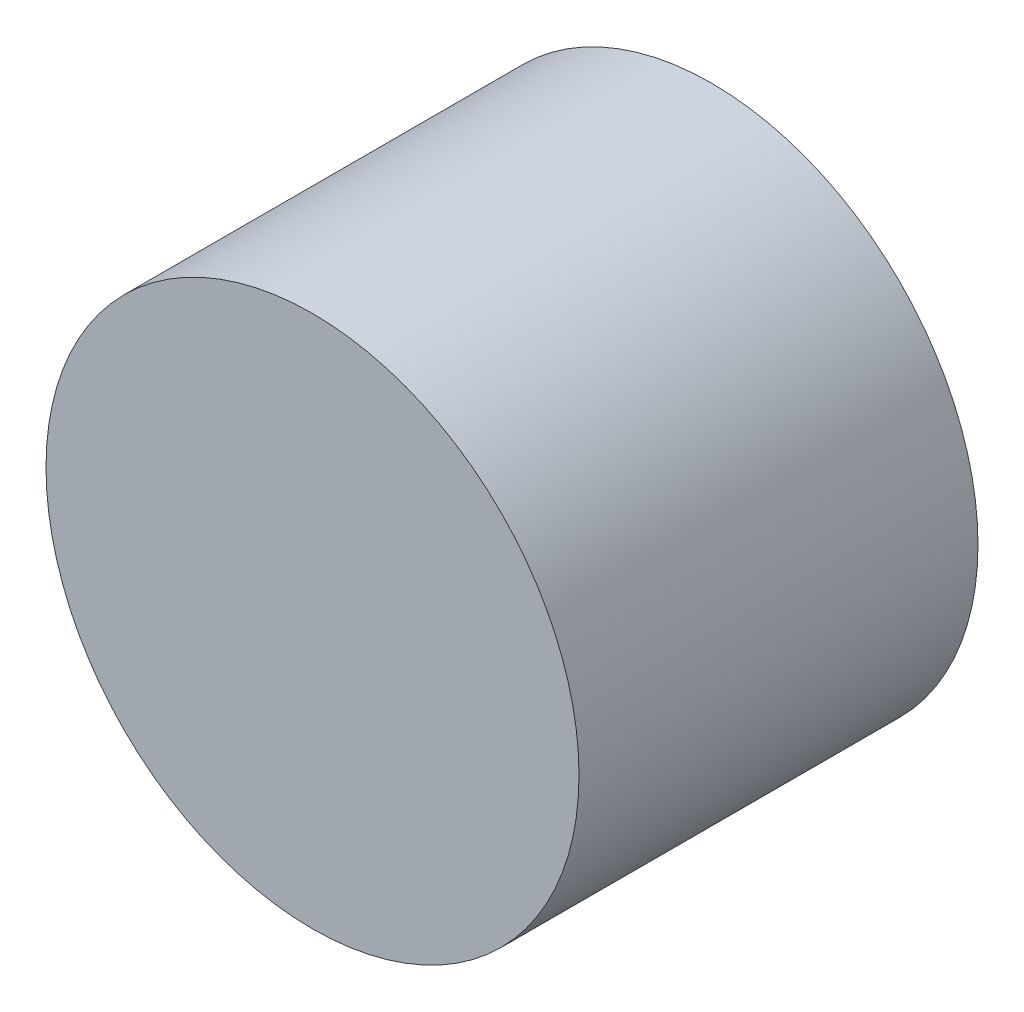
from build123d import *

# Parameters (mm, degrees)
SKETCH1_R           = 35
BOSS_EXTRUDE1_DEPTH = 52.4


with BuildPart() as part:
    # Sketch1 → Boss-Extrude1 (new body)
    with BuildSketch(Plane(origin=(0, 0, 0), x_dir=(0, 1, 0), z_dir=(0, 0, 1))):
        with Locations(Location((0, 0, 0), (0, 0, 270))):
            Circle(SKETCH1_R)
    extrude(amount=BOSS_EXTRUDE1_DEPTH)


solid = part.part
